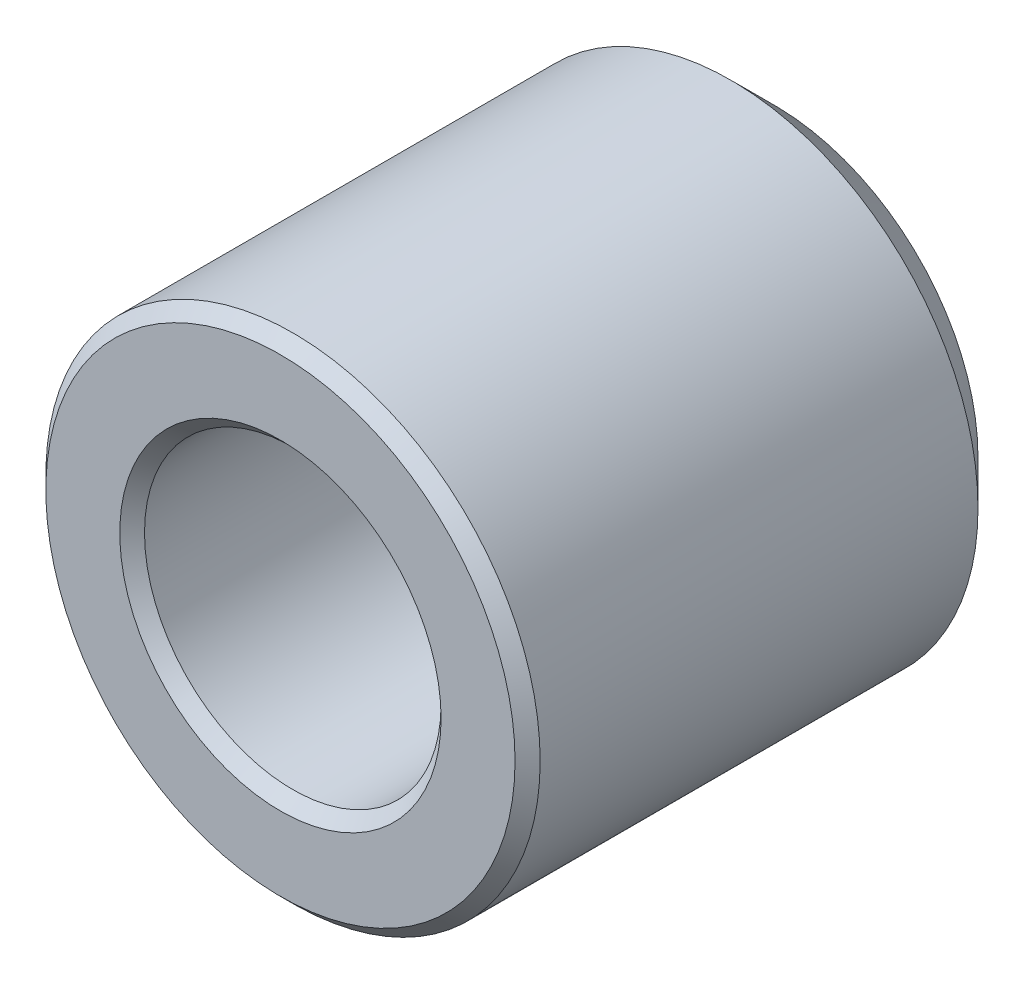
ISO-10303-21;
HEADER;
FILE_DESCRIPTION(('STEP AP214'),'2;1');
FILE_NAME('part.step','',(''),(''),'','','');
FILE_SCHEMA(('AUTOMOTIVE_DESIGN { 1 0 10303 214 1 1 1 1 }'));
ENDSEC;
DATA;
#1=APPLICATION_CONTEXT('core data for automotive mechanical design processes');
#2=APPLICATION_PROTOCOL_DEFINITION('international standard','automotive_design',2000,#1);
#3=PRODUCT_CONTEXT('',#1,'mechanical');
#4=PRODUCT('Part','Part','',(#3));
#5=PRODUCT_RELATED_PRODUCT_CATEGORY('part','',(#4));
#6=PRODUCT_DEFINITION_FORMATION('','',#4);
#7=PRODUCT_DEFINITION_CONTEXT('part definition',#1,'design');
#8=PRODUCT_DEFINITION('design','',#6,#7);
#9=PRODUCT_DEFINITION_SHAPE('','',#8);
#10=(LENGTH_UNIT() NAMED_UNIT(*) SI_UNIT(.MILLI.,.METRE.));
#11=(NAMED_UNIT(*) PLANE_ANGLE_UNIT() SI_UNIT($,.RADIAN.));
#12=(NAMED_UNIT(*) SI_UNIT($,.STERADIAN.) SOLID_ANGLE_UNIT());
#13=UNCERTAINTY_MEASURE_WITH_UNIT(LENGTH_MEASURE(1.E-05),#10,'distance_accuracy_value','');
#14=(GEOMETRIC_REPRESENTATION_CONTEXT(3) GLOBAL_UNCERTAINTY_ASSIGNED_CONTEXT((#13)) GLOBAL_UNIT_ASSIGNED_CONTEXT((#10,
#11,#12)) REPRESENTATION_CONTEXT('',''));
#15=CARTESIAN_POINT('',(0.,0.,0.));
#16=DIRECTION('',(0.,0.,1.));
#17=DIRECTION('',(1.,0.,0.));
#18=AXIS2_PLACEMENT_3D('',#15,#16,#17);
#19=CARTESIAN_POINT('',(0.,0.,10.));
#20=DIRECTION('',(0.,0.,1.));
#21=DIRECTION('',(1.,0.,0.));
#22=AXIS2_PLACEMENT_3D('',#19,#20,#21);
#23=CYLINDRICAL_SURFACE('',#22,1.7);
#24=CARTESIAN_POINT('',(0.,0.,0.254));
#25=DIRECTION('',(0.,0.,1.));
#26=DIRECTION('',(1.,0.,0.));
#27=AXIS2_PLACEMENT_3D('',#24,#25,#26);
#28=CIRCLE('',#27,1.7);
#29=CARTESIAN_POINT('',(1.7,0.,0.254));
#30=VERTEX_POINT('',#29);
#31=EDGE_CURVE('E23',#30,#30,#28,.F.);
#32=ORIENTED_EDGE('',*,*,#31,.T.);
#33=EDGE_LOOP('',(#32));
#34=FACE_BOUND('',#33,.T.);
#35=CARTESIAN_POINT('',(0.,0.,5.));
#36=DIRECTION('',(0.,0.,1.));
#37=DIRECTION('',(1.,0.,0.));
#38=AXIS2_PLACEMENT_3D('',#35,#36,#37);
#39=CIRCLE('',#38,1.7);
#40=CARTESIAN_POINT('',(1.7,0.,5.));
#41=VERTEX_POINT('',#40);
#42=EDGE_CURVE('E30',#41,#41,#39,.F.);
#43=ORIENTED_EDGE('',*,*,#42,.F.);
#44=EDGE_LOOP('',(#43));
#45=FACE_BOUND('',#44,.T.);
#46=ADVANCED_FACE('F12',(#34,#45),#23,.F.);
#47=CARTESIAN_POINT('',(0.,0.,0.));
#48=DIRECTION('',(0.,0.,1.));
#49=DIRECTION('',(1.,0.,0.));
#50=AXIS2_PLACEMENT_3D('',#47,#48,#49);
#51=CYLINDRICAL_SURFACE('',#50,5.);
#52=CARTESIAN_POINT('',(0.,0.,0.889));
#53=DIRECTION('',(0.,0.,1.));
#54=DIRECTION('',(1.,0.,0.));
#55=AXIS2_PLACEMENT_3D('',#52,#53,#54);
#56=CIRCLE('',#55,5.);
#57=CARTESIAN_POINT('',(5.,0.,0.889));
#58=VERTEX_POINT('',#57);
#59=EDGE_CURVE('E40',#58,#58,#56,.T.);
#60=ORIENTED_EDGE('',*,*,#59,.T.);
#61=EDGE_LOOP('',(#60));
#62=FACE_BOUND('',#61,.T.);
#63=CARTESIAN_POINT('',(0.,0.,9.746));
#64=DIRECTION('',(0.,0.,1.));
#65=DIRECTION('',(1.,0.,0.));
#66=AXIS2_PLACEMENT_3D('',#63,#64,#65);
#67=CIRCLE('',#66,5.);
#68=CARTESIAN_POINT('',(5.,0.,9.746));
#69=VERTEX_POINT('',#68);
#70=EDGE_CURVE('E43',#69,#69,#67,.F.);
#71=ORIENTED_EDGE('',*,*,#70,.T.);
#72=EDGE_LOOP('',(#71));
#73=FACE_BOUND('',#72,.T.);
#74=ADVANCED_FACE('F67',(#62,#73),#51,.T.);
#75=CARTESIAN_POINT('',(0.,0.,0.));
#76=DIRECTION('',(0.,0.,1.));
#77=DIRECTION('',(1.,0.,0.));
#78=AXIS2_PLACEMENT_3D('',#75,#76,#77);
#79=PLANE('',#78);
#80=CARTESIAN_POINT('',(0.,0.,0.));
#81=DIRECTION('',(0.,0.,1.));
#82=DIRECTION('',(1.,0.,0.));
#83=AXIS2_PLACEMENT_3D('',#80,#81,#82);
#84=CIRCLE('',#83,1.954);
#85=CARTESIAN_POINT('',(1.954,0.,0.));
#86=VERTEX_POINT('',#85);
#87=EDGE_CURVE('E27',#86,#86,#84,.T.);
#88=ORIENTED_EDGE('',*,*,#87,.T.);
#89=EDGE_LOOP('',(#88));
#90=FACE_BOUND('',#89,.T.);
#91=CARTESIAN_POINT('',(0.,0.,0.));
#92=DIRECTION('',(0.,0.,1.));
#93=DIRECTION('',(1.,0.,0.));
#94=AXIS2_PLACEMENT_3D('',#91,#92,#93);
#95=CIRCLE('',#94,4.111);
#96=CARTESIAN_POINT('',(4.111,0.,0.));
#97=VERTEX_POINT('',#96);
#98=EDGE_CURVE('E37',#97,#97,#95,.F.);
#99=ORIENTED_EDGE('',*,*,#98,.T.);
#100=EDGE_LOOP('',(#99));
#101=FACE_BOUND('',#100,.T.);
#102=ADVANCED_FACE('F72',(#90,#101),#79,.F.);
#103=CARTESIAN_POINT('',(0.,0.,10.));
#104=DIRECTION('',(0.,0.,1.));
#105=DIRECTION('',(1.,0.,0.));
#106=AXIS2_PLACEMENT_3D('',#103,#104,#105);
#107=PLANE('',#106);
#108=CARTESIAN_POINT('',(0.,0.,10.));
#109=DIRECTION('',(0.,0.,1.));
#110=DIRECTION('',(1.,0.,0.));
#111=AXIS2_PLACEMENT_3D('',#108,#109,#110);
#112=CIRCLE('',#111,3.25);
#113=CARTESIAN_POINT('',(3.25,0.,10.));
#114=VERTEX_POINT('',#113);
#115=EDGE_CURVE('E8',#114,#114,#112,.F.);
#116=ORIENTED_EDGE('',*,*,#115,.T.);
#117=EDGE_LOOP('',(#116));
#118=FACE_BOUND('',#117,.T.);
#119=CARTESIAN_POINT('',(0.,0.,10.));
#120=DIRECTION('',(0.,0.,1.));
#121=DIRECTION('',(1.,0.,0.));
#122=AXIS2_PLACEMENT_3D('',#119,#120,#121);
#123=CIRCLE('',#122,4.746);
#124=CARTESIAN_POINT('',(4.746,0.,10.));
#125=VERTEX_POINT('',#124);
#126=EDGE_CURVE('E32',#125,#125,#123,.T.);
#127=ORIENTED_EDGE('',*,*,#126,.T.);
#128=EDGE_LOOP('',(#127));
#129=FACE_BOUND('',#128,.T.);
#130=ADVANCED_FACE('F79',(#118,#129),#107,.T.);
#131=CARTESIAN_POINT('',(0.,0.,10.));
#132=DIRECTION('',(0.,0.,-1.));
#133=DIRECTION('',(-1.,0.,0.));
#134=AXIS2_PLACEMENT_3D('',#131,#132,#133);
#135=CONICAL_SURFACE('',#134,4.746,0.785398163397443);
#136=ORIENTED_EDGE('',*,*,#70,.F.);
#137=EDGE_LOOP('',(#136));
#138=FACE_BOUND('',#137,.T.);
#139=ORIENTED_EDGE('',*,*,#126,.F.);
#140=EDGE_LOOP('',(#139));
#141=FACE_BOUND('',#140,.T.);
#142=ADVANCED_FACE('F82',(#138,#141),#135,.T.);
#143=CARTESIAN_POINT('',(0.,0.,0.889));
#144=DIRECTION('',(0.,0.,1.));
#145=DIRECTION('',(1.,0.,0.));
#146=AXIS2_PLACEMENT_3D('',#143,#144,#145);
#147=CONICAL_SURFACE('',#146,5.,0.78539816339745);
#148=ORIENTED_EDGE('',*,*,#98,.F.);
#149=EDGE_LOOP('',(#148));
#150=FACE_BOUND('',#149,.T.);
#151=ORIENTED_EDGE('',*,*,#59,.F.);
#152=EDGE_LOOP('',(#151));
#153=FACE_BOUND('',#152,.T.);
#154=ADVANCED_FACE('F86',(#150,#153),#147,.T.);
#155=CARTESIAN_POINT('',(0.,0.,0.));
#156=DIRECTION('',(0.,0.,-1.));
#157=DIRECTION('',(-1.,0.,0.));
#158=AXIS2_PLACEMENT_3D('',#155,#156,#157);
#159=CONICAL_SURFACE('',#158,1.954,0.785398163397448);
#160=ORIENTED_EDGE('',*,*,#31,.F.);
#161=EDGE_LOOP('',(#160));
#162=FACE_BOUND('',#161,.T.);
#163=ORIENTED_EDGE('',*,*,#87,.F.);
#164=EDGE_LOOP('',(#163));
#165=FACE_BOUND('',#164,.T.);
#166=ADVANCED_FACE('F63',(#162,#165),#159,.F.);
#167=CARTESIAN_POINT('',(0.,0.,5.));
#168=DIRECTION('',(0.,0.,1.));
#169=DIRECTION('',(1.,0.,0.));
#170=AXIS2_PLACEMENT_3D('',#167,#168,#169);
#171=PLANE('',#170);
#172=CARTESIAN_POINT('',(0.,0.,5.));
#173=DIRECTION('',(0.,0.,1.));
#174=DIRECTION('',(1.,0.,0.));
#175=AXIS2_PLACEMENT_3D('',#172,#173,#174);
#176=CIRCLE('',#175,3.);
#177=CARTESIAN_POINT('',(3.,0.,5.));
#178=VERTEX_POINT('',#177);
#179=EDGE_CURVE('E33',#178,#178,#176,.T.);
#180=ORIENTED_EDGE('',*,*,#179,.T.);
#181=EDGE_LOOP('',(#180));
#182=FACE_BOUND('',#181,.T.);
#183=ORIENTED_EDGE('',*,*,#42,.T.);
#184=EDGE_LOOP('',(#183));
#185=FACE_BOUND('',#184,.T.);
#186=ADVANCED_FACE('F51',(#182,#185),#171,.T.);
#187=CARTESIAN_POINT('',(0.,0.,5.));
#188=DIRECTION('',(0.,0.,1.));
#189=DIRECTION('',(1.,0.,0.));
#190=AXIS2_PLACEMENT_3D('',#187,#188,#189);
#191=CYLINDRICAL_SURFACE('',#190,3.);
#192=CARTESIAN_POINT('',(0.,0.,9.75));
#193=DIRECTION('',(0.,0.,1.));
#194=DIRECTION('',(1.,0.,0.));
#195=AXIS2_PLACEMENT_3D('',#192,#193,#194);
#196=CIRCLE('',#195,3.);
#197=CARTESIAN_POINT('',(3.,0.,9.75));
#198=VERTEX_POINT('',#197);
#199=EDGE_CURVE('E19',#198,#198,#196,.T.);
#200=ORIENTED_EDGE('',*,*,#199,.T.);
#201=EDGE_LOOP('',(#200));
#202=FACE_BOUND('',#201,.T.);
#203=ORIENTED_EDGE('',*,*,#179,.F.);
#204=EDGE_LOOP('',(#203));
#205=FACE_BOUND('',#204,.T.);
#206=ADVANCED_FACE('F54',(#202,#205),#191,.F.);
#207=CARTESIAN_POINT('',(0.,0.,9.75));
#208=DIRECTION('',(0.,0.,1.));
#209=DIRECTION('',(1.,0.,0.));
#210=AXIS2_PLACEMENT_3D('',#207,#208,#209);
#211=CONICAL_SURFACE('',#210,3.,0.785398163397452);
#212=ORIENTED_EDGE('',*,*,#115,.F.);
#213=EDGE_LOOP('',(#212));
#214=FACE_BOUND('',#213,.T.);
#215=ORIENTED_EDGE('',*,*,#199,.F.);
#216=EDGE_LOOP('',(#215));
#217=FACE_BOUND('',#216,.T.);
#218=ADVANCED_FACE('F14',(#214,#217),#211,.F.);
#219=CLOSED_SHELL('',(#46,#74,#102,#130,#142,#154,#166,#186,#206,#218));
#220=MANIFOLD_SOLID_BREP('B1',#219);
#221=ADVANCED_BREP_SHAPE_REPRESENTATION('',(#18,#220),#14);
#222=SHAPE_DEFINITION_REPRESENTATION(#9,#221);
ENDSEC;
END-ISO-10303-21;
